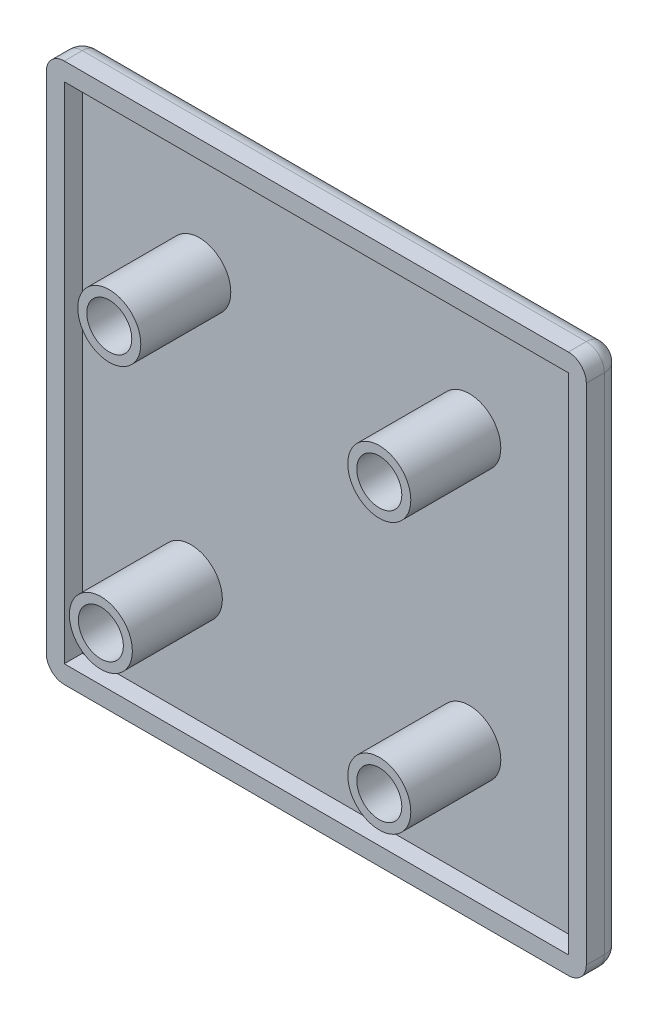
ISO-10303-21;
HEADER;
FILE_DESCRIPTION(('STEP AP214'),'2;1');
FILE_NAME('part.step','',(''),(''),'','','');
FILE_SCHEMA(('AUTOMOTIVE_DESIGN { 1 0 10303 214 1 1 1 1 }'));
ENDSEC;
DATA;
#1=APPLICATION_CONTEXT('core data for automotive mechanical design processes');
#2=APPLICATION_PROTOCOL_DEFINITION('international standard','automotive_design',2000,#1);
#3=PRODUCT_CONTEXT('',#1,'mechanical');
#4=PRODUCT('Part','Part','',(#3));
#5=PRODUCT_RELATED_PRODUCT_CATEGORY('part','',(#4));
#6=PRODUCT_DEFINITION_FORMATION('','',#4);
#7=PRODUCT_DEFINITION_CONTEXT('part definition',#1,'design');
#8=PRODUCT_DEFINITION('design','',#6,#7);
#9=PRODUCT_DEFINITION_SHAPE('','',#8);
#10=(LENGTH_UNIT() NAMED_UNIT(*) SI_UNIT(.MILLI.,.METRE.));
#11=(NAMED_UNIT(*) PLANE_ANGLE_UNIT() SI_UNIT($,.RADIAN.));
#12=(NAMED_UNIT(*) SI_UNIT($,.STERADIAN.) SOLID_ANGLE_UNIT());
#13=UNCERTAINTY_MEASURE_WITH_UNIT(LENGTH_MEASURE(1.E-05),#10,'distance_accuracy_value','');
#14=(GEOMETRIC_REPRESENTATION_CONTEXT(3) GLOBAL_UNCERTAINTY_ASSIGNED_CONTEXT((#13)) GLOBAL_UNIT_ASSIGNED_CONTEXT((#10,
#11,#12)) REPRESENTATION_CONTEXT('',''));
#15=CARTESIAN_POINT('',(0.,0.,0.));
#16=DIRECTION('',(0.,0.,1.));
#17=DIRECTION('',(1.,0.,0.));
#18=AXIS2_PLACEMENT_3D('',#15,#16,#17);
#19=CARTESIAN_POINT('',(0.,0.,0.));
#20=DIRECTION('',(0.,0.,1.));
#21=DIRECTION('',(1.,0.,0.));
#22=AXIS2_PLACEMENT_3D('',#19,#20,#21);
#23=PLANE('',#22);
#24=DIRECTION('',(0.,-1.,0.));
#25=VECTOR('',#24,1.);
#26=CARTESIAN_POINT('',(-28.,30.,0.));
#27=LINE('',#26,#25);
#28=CARTESIAN_POINT('',(-28.,28.,0.));
#29=VERTEX_POINT('',#28);
#30=CARTESIAN_POINT('',(-28.,-28.,0.));
#31=VERTEX_POINT('',#30);
#32=EDGE_CURVE('E140',#29,#31,#27,.T.);
#33=ORIENTED_EDGE('',*,*,#32,.T.);
#34=DIRECTION('',(1.,0.,0.));
#35=VECTOR('',#34,1.);
#36=CARTESIAN_POINT('',(-30.,-28.,0.));
#37=LINE('',#36,#35);
#38=CARTESIAN_POINT('',(28.,-28.,0.));
#39=VERTEX_POINT('',#38);
#40=EDGE_CURVE('E133',#31,#39,#37,.T.);
#41=ORIENTED_EDGE('',*,*,#40,.T.);
#42=DIRECTION('',(0.,1.,0.));
#43=VECTOR('',#42,1.);
#44=CARTESIAN_POINT('',(28.,30.,0.));
#45=LINE('',#44,#43);
#46=CARTESIAN_POINT('',(28.,28.,0.));
#47=VERTEX_POINT('',#46);
#48=EDGE_CURVE('E137',#39,#47,#45,.T.);
#49=ORIENTED_EDGE('',*,*,#48,.T.);
#50=DIRECTION('',(-1.,0.,0.));
#51=VECTOR('',#50,1.);
#52=CARTESIAN_POINT('',(-30.,28.,0.));
#53=LINE('',#52,#51);
#54=EDGE_CURVE('E158',#47,#29,#53,.T.);
#55=ORIENTED_EDGE('',*,*,#54,.T.);
#56=EDGE_LOOP('',(#33,#41,#49,#55));
#57=FACE_BOUND('',#56,.T.);
#58=CARTESIAN_POINT('',(-15.,15.,0.));
#59=DIRECTION('',(0.,0.,1.));
#60=DIRECTION('',(1.,0.,0.));
#61=AXIS2_PLACEMENT_3D('',#58,#59,#60);
#62=CIRCLE('',#61,3.5);
#63=CARTESIAN_POINT('',(-11.5,15.,0.));
#64=VERTEX_POINT('',#63);
#65=EDGE_CURVE('E353',#64,#64,#62,.T.);
#66=ORIENTED_EDGE('',*,*,#65,.F.);
#67=EDGE_LOOP('',(#66));
#68=FACE_BOUND('',#67,.T.);
#69=CARTESIAN_POINT('',(15.,15.,0.));
#70=DIRECTION('',(0.,0.,1.));
#71=DIRECTION('',(1.,0.,0.));
#72=AXIS2_PLACEMENT_3D('',#69,#70,#71);
#73=CIRCLE('',#72,3.5);
#74=CARTESIAN_POINT('',(18.5,15.,0.));
#75=VERTEX_POINT('',#74);
#76=EDGE_CURVE('E361',#75,#75,#73,.T.);
#77=ORIENTED_EDGE('',*,*,#76,.F.);
#78=EDGE_LOOP('',(#77));
#79=FACE_BOUND('',#78,.T.);
#80=CARTESIAN_POINT('',(15.,-15.,0.));
#81=DIRECTION('',(0.,0.,1.));
#82=DIRECTION('',(1.,0.,0.));
#83=AXIS2_PLACEMENT_3D('',#80,#81,#82);
#84=CIRCLE('',#83,3.5);
#85=CARTESIAN_POINT('',(18.5,-15.,0.));
#86=VERTEX_POINT('',#85);
#87=EDGE_CURVE('E370',#86,#86,#84,.T.);
#88=ORIENTED_EDGE('',*,*,#87,.F.);
#89=EDGE_LOOP('',(#88));
#90=FACE_BOUND('',#89,.T.);
#91=CARTESIAN_POINT('',(-15.9380449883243,-15.,0.));
#92=DIRECTION('',(0.,0.,1.));
#93=DIRECTION('',(1.,0.,0.));
#94=AXIS2_PLACEMENT_3D('',#91,#92,#93);
#95=CIRCLE('',#94,3.5);
#96=CARTESIAN_POINT('',(-12.4380449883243,-15.,0.));
#97=VERTEX_POINT('',#96);
#98=EDGE_CURVE('E379',#97,#97,#95,.T.);
#99=ORIENTED_EDGE('',*,*,#98,.F.);
#100=EDGE_LOOP('',(#99));
#101=FACE_BOUND('',#100,.T.);
#102=ADVANCED_FACE('F33',(#57,#68,#79,#90,#101),#23,.T.);
#103=CARTESIAN_POINT('',(-30.,30.,2.));
#104=DIRECTION('',(1.,0.,0.));
#105=DIRECTION('',(0.,1.,0.));
#106=AXIS2_PLACEMENT_3D('',#103,#104,#105);
#107=PLANE('',#106);
#108=DIRECTION('',(0.,-1.,0.));
#109=VECTOR('',#108,1.);
#110=CARTESIAN_POINT('',(-30.,30.,2.));
#111=LINE('',#110,#109);
#112=CARTESIAN_POINT('',(-30.,28.,2.));
#113=VERTEX_POINT('',#112);
#114=CARTESIAN_POINT('',(-30.,-28.,2.));
#115=VERTEX_POINT('',#114);
#116=EDGE_CURVE('E171',#113,#115,#111,.T.);
#117=ORIENTED_EDGE('',*,*,#116,.F.);
#118=DIRECTION('',(0.,0.,-1.));
#119=VECTOR('',#118,1.);
#120=CARTESIAN_POINT('',(-30.,28.,2.));
#121=LINE('',#120,#119);
#122=CARTESIAN_POINT('',(-30.,28.,0.));
#123=VERTEX_POINT('',#122);
#124=EDGE_CURVE('E187',#113,#123,#121,.T.);
#125=ORIENTED_EDGE('',*,*,#124,.T.);
#126=DIRECTION('',(0.,-1.,0.));
#127=VECTOR('',#126,1.);
#128=CARTESIAN_POINT('',(-30.,30.,0.));
#129=LINE('',#128,#127);
#130=CARTESIAN_POINT('',(-30.,-28.,0.));
#131=VERTEX_POINT('',#130);
#132=EDGE_CURVE('E183',#123,#131,#129,.T.);
#133=ORIENTED_EDGE('',*,*,#132,.T.);
#134=DIRECTION('',(0.,0.,-1.));
#135=VECTOR('',#134,1.);
#136=CARTESIAN_POINT('',(-30.,-28.,2.));
#137=LINE('',#136,#135);
#138=EDGE_CURVE('E185',#131,#115,#137,.F.);
#139=ORIENTED_EDGE('',*,*,#138,.T.);
#140=EDGE_LOOP('',(#117,#125,#133,#139));
#141=FACE_BOUND('',#140,.T.);
#142=ADVANCED_FACE('F293',(#141),#107,.F.);
#143=CARTESIAN_POINT('',(-30.,-30.,2.));
#144=DIRECTION('',(0.,1.,0.));
#145=DIRECTION('',(0.,0.,1.));
#146=AXIS2_PLACEMENT_3D('',#143,#144,#145);
#147=PLANE('',#146);
#148=DIRECTION('',(1.,0.,0.));
#149=VECTOR('',#148,1.);
#150=CARTESIAN_POINT('',(-30.,-30.,0.));
#151=LINE('',#150,#149);
#152=CARTESIAN_POINT('',(-28.,-30.,0.));
#153=VERTEX_POINT('',#152);
#154=CARTESIAN_POINT('',(28.,-30.,0.));
#155=VERTEX_POINT('',#154);
#156=EDGE_CURVE('E210',#153,#155,#151,.T.);
#157=ORIENTED_EDGE('',*,*,#156,.T.);
#158=DIRECTION('',(0.,0.,-1.));
#159=VECTOR('',#158,1.);
#160=CARTESIAN_POINT('',(28.,-30.,2.));
#161=LINE('',#160,#159);
#162=CARTESIAN_POINT('',(28.,-30.,2.));
#163=VERTEX_POINT('',#162);
#164=EDGE_CURVE('E214',#155,#163,#161,.F.);
#165=ORIENTED_EDGE('',*,*,#164,.T.);
#166=DIRECTION('',(1.,0.,0.));
#167=VECTOR('',#166,1.);
#168=CARTESIAN_POINT('',(-30.,-30.,2.));
#169=LINE('',#168,#167);
#170=CARTESIAN_POINT('',(-28.,-30.,2.));
#171=VERTEX_POINT('',#170);
#172=EDGE_CURVE('E174',#171,#163,#169,.T.);
#173=ORIENTED_EDGE('',*,*,#172,.F.);
#174=DIRECTION('',(0.,0.,-1.));
#175=VECTOR('',#174,1.);
#176=CARTESIAN_POINT('',(-28.,-30.,2.));
#177=LINE('',#176,#175);
#178=EDGE_CURVE('E212',#171,#153,#177,.T.);
#179=ORIENTED_EDGE('',*,*,#178,.T.);
#180=EDGE_LOOP('',(#157,#165,#173,#179));
#181=FACE_BOUND('',#180,.T.);
#182=ADVANCED_FACE('F297',(#181),#147,.F.);
#183=CARTESIAN_POINT('',(30.,30.,2.));
#184=DIRECTION('',(-1.,0.,0.));
#185=DIRECTION('',(0.,0.,1.));
#186=AXIS2_PLACEMENT_3D('',#183,#184,#185);
#187=PLANE('',#186);
#188=DIRECTION('',(0.,1.,0.));
#189=VECTOR('',#188,1.);
#190=CARTESIAN_POINT('',(30.,30.,2.));
#191=LINE('',#190,#189);
#192=CARTESIAN_POINT('',(30.,-28.,2.));
#193=VERTEX_POINT('',#192);
#194=CARTESIAN_POINT('',(30.,28.,2.));
#195=VERTEX_POINT('',#194);
#196=EDGE_CURVE('E177',#193,#195,#191,.T.);
#197=ORIENTED_EDGE('',*,*,#196,.F.);
#198=DIRECTION('',(0.,0.,-1.));
#199=VECTOR('',#198,1.);
#200=CARTESIAN_POINT('',(30.,-28.,2.));
#201=LINE('',#200,#199);
#202=CARTESIAN_POINT('',(30.,-28.,0.));
#203=VERTEX_POINT('',#202);
#204=EDGE_CURVE('E208',#193,#203,#201,.T.);
#205=ORIENTED_EDGE('',*,*,#204,.T.);
#206=DIRECTION('',(0.,1.,0.));
#207=VECTOR('',#206,1.);
#208=CARTESIAN_POINT('',(30.,30.,0.));
#209=LINE('',#208,#207);
#210=CARTESIAN_POINT('',(30.,28.,0.));
#211=VERTEX_POINT('',#210);
#212=EDGE_CURVE('E206',#203,#211,#209,.T.);
#213=ORIENTED_EDGE('',*,*,#212,.T.);
#214=DIRECTION('',(0.,0.,-1.));
#215=VECTOR('',#214,1.);
#216=CARTESIAN_POINT('',(30.,28.,2.));
#217=LINE('',#216,#215);
#218=EDGE_CURVE('E204',#211,#195,#217,.F.);
#219=ORIENTED_EDGE('',*,*,#218,.T.);
#220=EDGE_LOOP('',(#197,#205,#213,#219));
#221=FACE_BOUND('',#220,.T.);
#222=ADVANCED_FACE('F599',(#221),#187,.F.);
#223=CARTESIAN_POINT('',(-30.,30.,2.));
#224=DIRECTION('',(0.,-1.,0.));
#225=DIRECTION('',(1.,0.,0.));
#226=AXIS2_PLACEMENT_3D('',#223,#224,#225);
#227=PLANE('',#226);
#228=DIRECTION('',(-1.,0.,0.));
#229=VECTOR('',#228,1.);
#230=CARTESIAN_POINT('',(-30.,30.,0.));
#231=LINE('',#230,#229);
#232=CARTESIAN_POINT('',(28.,30.,0.));
#233=VERTEX_POINT('',#232);
#234=CARTESIAN_POINT('',(-28.,30.,0.));
#235=VERTEX_POINT('',#234);
#236=EDGE_CURVE('E192',#233,#235,#231,.T.);
#237=ORIENTED_EDGE('',*,*,#236,.T.);
#238=DIRECTION('',(0.,0.,-1.));
#239=VECTOR('',#238,1.);
#240=CARTESIAN_POINT('',(-28.,30.,2.));
#241=LINE('',#240,#239);
#242=CARTESIAN_POINT('',(-28.,30.,2.));
#243=VERTEX_POINT('',#242);
#244=EDGE_CURVE('E194',#235,#243,#241,.F.);
#245=ORIENTED_EDGE('',*,*,#244,.T.);
#246=DIRECTION('',(-1.,0.,0.));
#247=VECTOR('',#246,1.);
#248=CARTESIAN_POINT('',(-30.,30.,2.));
#249=LINE('',#248,#247);
#250=CARTESIAN_POINT('',(28.,30.,2.));
#251=VERTEX_POINT('',#250);
#252=EDGE_CURVE('E180',#251,#243,#249,.T.);
#253=ORIENTED_EDGE('',*,*,#252,.F.);
#254=DIRECTION('',(0.,0.,-1.));
#255=VECTOR('',#254,1.);
#256=CARTESIAN_POINT('',(28.,30.,2.));
#257=LINE('',#256,#255);
#258=EDGE_CURVE('E190',#251,#233,#257,.T.);
#259=ORIENTED_EDGE('',*,*,#258,.T.);
#260=EDGE_LOOP('',(#237,#245,#253,#259));
#261=FACE_BOUND('',#260,.T.);
#262=ADVANCED_FACE('F590',(#261),#227,.F.);
#263=CARTESIAN_POINT('',(0.,0.,2.));
#264=DIRECTION('',(0.,0.,1.));
#265=DIRECTION('',(1.,0.,0.));
#266=AXIS2_PLACEMENT_3D('',#263,#264,#265);
#267=PLANE('',#266);
#268=DIRECTION('',(0.,-1.,0.));
#269=VECTOR('',#268,1.);
#270=CARTESIAN_POINT('',(-28.,30.,2.));
#271=LINE('',#270,#269);
#272=CARTESIAN_POINT('',(-28.,28.,2.));
#273=VERTEX_POINT('',#272);
#274=CARTESIAN_POINT('',(-28.,-28.,2.));
#275=VERTEX_POINT('',#274);
#276=EDGE_CURVE('E160',#273,#275,#271,.T.);
#277=ORIENTED_EDGE('',*,*,#276,.F.);
#278=DIRECTION('',(-1.,0.,0.));
#279=VECTOR('',#278,1.);
#280=CARTESIAN_POINT('',(-30.,28.,2.));
#281=LINE('',#280,#279);
#282=CARTESIAN_POINT('',(28.,28.,2.));
#283=VERTEX_POINT('',#282);
#284=EDGE_CURVE('E169',#283,#273,#281,.T.);
#285=ORIENTED_EDGE('',*,*,#284,.F.);
#286=DIRECTION('',(0.,1.,0.));
#287=VECTOR('',#286,1.);
#288=CARTESIAN_POINT('',(28.,30.,2.));
#289=LINE('',#288,#287);
#290=CARTESIAN_POINT('',(28.,-28.,2.));
#291=VERTEX_POINT('',#290);
#292=EDGE_CURVE('E167',#291,#283,#289,.T.);
#293=ORIENTED_EDGE('',*,*,#292,.F.);
#294=DIRECTION('',(1.,0.,0.));
#295=VECTOR('',#294,1.);
#296=CARTESIAN_POINT('',(-30.,-28.,2.));
#297=LINE('',#296,#295);
#298=EDGE_CURVE('E149',#275,#291,#297,.T.);
#299=ORIENTED_EDGE('',*,*,#298,.F.);
#300=EDGE_LOOP('',(#277,#285,#293,#299));
#301=FACE_BOUND('',#300,.T.);
#302=ORIENTED_EDGE('',*,*,#252,.T.);
#303=CARTESIAN_POINT('',(-28.,28.,2.));
#304=DIRECTION('',(0.,0.,1.));
#305=DIRECTION('',(1.,0.,0.));
#306=AXIS2_PLACEMENT_3D('',#303,#304,#305);
#307=CIRCLE('',#306,2.);
#308=EDGE_CURVE('E202',#243,#113,#307,.T.);
#309=ORIENTED_EDGE('',*,*,#308,.T.);
#310=ORIENTED_EDGE('',*,*,#116,.T.);
#311=CARTESIAN_POINT('',(-28.,-28.,2.));
#312=DIRECTION('',(0.,0.,1.));
#313=DIRECTION('',(1.,0.,0.));
#314=AXIS2_PLACEMENT_3D('',#311,#312,#313);
#315=CIRCLE('',#314,2.);
#316=EDGE_CURVE('E198',#115,#171,#315,.T.);
#317=ORIENTED_EDGE('',*,*,#316,.T.);
#318=ORIENTED_EDGE('',*,*,#172,.T.);
#319=CARTESIAN_POINT('',(28.,-28.,2.));
#320=DIRECTION('',(0.,0.,1.));
#321=DIRECTION('',(1.,0.,0.));
#322=AXIS2_PLACEMENT_3D('',#319,#320,#321);
#323=CIRCLE('',#322,2.);
#324=EDGE_CURVE('E200',#163,#193,#323,.T.);
#325=ORIENTED_EDGE('',*,*,#324,.T.);
#326=ORIENTED_EDGE('',*,*,#196,.T.);
#327=CARTESIAN_POINT('',(28.,28.,2.));
#328=DIRECTION('',(0.,0.,1.));
#329=DIRECTION('',(1.,0.,0.));
#330=AXIS2_PLACEMENT_3D('',#327,#328,#329);
#331=CIRCLE('',#330,2.);
#332=EDGE_CURVE('E196',#195,#251,#331,.T.);
#333=ORIENTED_EDGE('',*,*,#332,.T.);
#334=EDGE_LOOP('',(#302,#309,#310,#317,#318,#325,#326,#333));
#335=FACE_BOUND('',#334,.T.);
#336=ADVANCED_FACE('F580',(#301,#335),#267,.T.);
#337=CARTESIAN_POINT('',(0.,0.,-2.));
#338=DIRECTION('',(0.,0.,1.));
#339=DIRECTION('',(1.,0.,0.));
#340=AXIS2_PLACEMENT_3D('',#337,#338,#339);
#341=PLANE('',#340);
#342=DIRECTION('',(1.,0.,0.));
#343=VECTOR('',#342,1.);
#344=CARTESIAN_POINT('',(0.,-28.,-2.));
#345=LINE('',#344,#343);
#346=CARTESIAN_POINT('',(28.,-28.,-2.));
#347=VERTEX_POINT('',#346);
#348=CARTESIAN_POINT('',(-28.,-28.,-2.));
#349=VERTEX_POINT('',#348);
#350=EDGE_CURVE('E48',#347,#349,#345,.F.);
#351=ORIENTED_EDGE('',*,*,#350,.T.);
#352=DIRECTION('',(0.,-1.,0.));
#353=VECTOR('',#352,1.);
#354=CARTESIAN_POINT('',(-28.,0.,-2.));
#355=LINE('',#354,#353);
#356=CARTESIAN_POINT('',(-28.,28.,-2.));
#357=VERTEX_POINT('',#356);
#358=EDGE_CURVE('E220',#349,#357,#355,.F.);
#359=ORIENTED_EDGE('',*,*,#358,.T.);
#360=DIRECTION('',(-1.,0.,0.));
#361=VECTOR('',#360,1.);
#362=CARTESIAN_POINT('',(0.,28.,-2.));
#363=LINE('',#362,#361);
#364=CARTESIAN_POINT('',(28.,28.,-2.));
#365=VERTEX_POINT('',#364);
#366=EDGE_CURVE('E216',#357,#365,#363,.F.);
#367=ORIENTED_EDGE('',*,*,#366,.T.);
#368=DIRECTION('',(0.,1.,0.));
#369=VECTOR('',#368,1.);
#370=CARTESIAN_POINT('',(28.,0.,-2.));
#371=LINE('',#370,#369);
#372=EDGE_CURVE('E53',#365,#347,#371,.F.);
#373=ORIENTED_EDGE('',*,*,#372,.T.);
#374=EDGE_LOOP('',(#351,#359,#367,#373));
#375=FACE_BOUND('',#374,.T.);
#376=ADVANCED_FACE('F332',(#375),#341,.F.);
#377=CARTESIAN_POINT('',(-28.,30.,2.));
#378=DIRECTION('',(1.,0.,0.));
#379=DIRECTION('',(0.,1.,0.));
#380=AXIS2_PLACEMENT_3D('',#377,#378,#379);
#381=PLANE('',#380);
#382=ORIENTED_EDGE('',*,*,#32,.F.);
#383=DIRECTION('',(0.,0.,-1.));
#384=VECTOR('',#383,1.);
#385=CARTESIAN_POINT('',(-28.,28.,2.));
#386=LINE('',#385,#384);
#387=EDGE_CURVE('E163',#273,#29,#386,.T.);
#388=ORIENTED_EDGE('',*,*,#387,.F.);
#389=ORIENTED_EDGE('',*,*,#276,.T.);
#390=DIRECTION('',(0.,0.,-1.));
#391=VECTOR('',#390,1.);
#392=CARTESIAN_POINT('',(-28.,-28.,2.));
#393=LINE('',#392,#391);
#394=EDGE_CURVE('E153',#275,#31,#393,.T.);
#395=ORIENTED_EDGE('',*,*,#394,.T.);
#396=EDGE_LOOP('',(#382,#388,#389,#395));
#397=FACE_BOUND('',#396,.T.);
#398=ADVANCED_FACE('F329',(#397),#381,.T.);
#399=CARTESIAN_POINT('',(-30.,-28.,2.));
#400=DIRECTION('',(0.,1.,0.));
#401=DIRECTION('',(0.,0.,1.));
#402=AXIS2_PLACEMENT_3D('',#399,#400,#401);
#403=PLANE('',#402);
#404=ORIENTED_EDGE('',*,*,#40,.F.);
#405=ORIENTED_EDGE('',*,*,#394,.F.);
#406=ORIENTED_EDGE('',*,*,#298,.T.);
#407=DIRECTION('',(0.,0.,-1.));
#408=VECTOR('',#407,1.);
#409=CARTESIAN_POINT('',(28.,-28.,2.));
#410=LINE('',#409,#408);
#411=EDGE_CURVE('E146',#291,#39,#410,.T.);
#412=ORIENTED_EDGE('',*,*,#411,.T.);
#413=EDGE_LOOP('',(#404,#405,#406,#412));
#414=FACE_BOUND('',#413,.T.);
#415=ADVANCED_FACE('F147',(#414),#403,.T.);
#416=CARTESIAN_POINT('',(28.,30.,2.));
#417=DIRECTION('',(-1.,0.,0.));
#418=DIRECTION('',(0.,0.,1.));
#419=AXIS2_PLACEMENT_3D('',#416,#417,#418);
#420=PLANE('',#419);
#421=ORIENTED_EDGE('',*,*,#48,.F.);
#422=ORIENTED_EDGE('',*,*,#411,.F.);
#423=ORIENTED_EDGE('',*,*,#292,.T.);
#424=DIRECTION('',(0.,0.,-1.));
#425=VECTOR('',#424,1.);
#426=CARTESIAN_POINT('',(28.,28.,2.));
#427=LINE('',#426,#425);
#428=EDGE_CURVE('E154',#283,#47,#427,.T.);
#429=ORIENTED_EDGE('',*,*,#428,.T.);
#430=EDGE_LOOP('',(#421,#422,#423,#429));
#431=FACE_BOUND('',#430,.T.);
#432=ADVANCED_FACE('F156',(#431),#420,.T.);
#433=CARTESIAN_POINT('',(-30.,28.,2.));
#434=DIRECTION('',(0.,-1.,0.));
#435=DIRECTION('',(1.,0.,0.));
#436=AXIS2_PLACEMENT_3D('',#433,#434,#435);
#437=PLANE('',#436);
#438=ORIENTED_EDGE('',*,*,#54,.F.);
#439=ORIENTED_EDGE('',*,*,#428,.F.);
#440=ORIENTED_EDGE('',*,*,#284,.T.);
#441=ORIENTED_EDGE('',*,*,#387,.T.);
#442=EDGE_LOOP('',(#438,#439,#440,#441));
#443=FACE_BOUND('',#442,.T.);
#444=ADVANCED_FACE('F337',(#443),#437,.T.);
#445=CARTESIAN_POINT('',(28.,-28.,2.));
#446=DIRECTION('',(0.,0.,-1.));
#447=DIRECTION('',(-1.,0.,0.));
#448=AXIS2_PLACEMENT_3D('',#445,#446,#447);
#449=CYLINDRICAL_SURFACE('',#448,2.);
#450=CARTESIAN_POINT('',(28.,-28.,0.));
#451=DIRECTION('',(0.,0.,-1.));
#452=DIRECTION('',(-1.,0.,0.));
#453=AXIS2_PLACEMENT_3D('',#450,#451,#452);
#454=CIRCLE('',#453,2.);
#455=EDGE_CURVE('E254',#203,#155,#454,.T.);
#456=ORIENTED_EDGE('',*,*,#455,.F.);
#457=ORIENTED_EDGE('',*,*,#204,.F.);
#458=ORIENTED_EDGE('',*,*,#324,.F.);
#459=ORIENTED_EDGE('',*,*,#164,.F.);
#460=EDGE_LOOP('',(#456,#457,#458,#459));
#461=FACE_BOUND('',#460,.T.);
#462=ADVANCED_FACE('F35',(#461),#449,.T.);
#463=CARTESIAN_POINT('',(28.,-28.,0.));
#464=DIRECTION('',(0.,0.,1.));
#465=DIRECTION('',(1.,0.,0.));
#466=AXIS2_PLACEMENT_3D('',#463,#464,#465);
#467=SPHERICAL_SURFACE('',#466,2.);
#468=CARTESIAN_POINT('',(28.,-28.,0.));
#469=DIRECTION('',(0.,-1.,0.));
#470=DIRECTION('',(1.,0.,0.));
#471=AXIS2_PLACEMENT_3D('',#468,#469,#470);
#472=CIRCLE('',#471,2.);
#473=EDGE_CURVE('E249',#203,#347,#472,.F.);
#474=ORIENTED_EDGE('',*,*,#473,.F.);
#475=ORIENTED_EDGE('',*,*,#455,.T.);
#476=CARTESIAN_POINT('',(28.,-28.,0.));
#477=DIRECTION('',(1.,0.,0.));
#478=DIRECTION('',(0.,0.,-1.));
#479=AXIS2_PLACEMENT_3D('',#476,#477,#478);
#480=CIRCLE('',#479,2.);
#481=EDGE_CURVE('E251',#347,#155,#480,.F.);
#482=ORIENTED_EDGE('',*,*,#481,.F.);
#483=EDGE_LOOP('',(#474,#475,#482));
#484=FACE_BOUND('',#483,.T.);
#485=ADVANCED_FACE('F343',(#484),#467,.T.);
#486=CARTESIAN_POINT('',(-28.,-28.,2.));
#487=DIRECTION('',(0.,0.,-1.));
#488=DIRECTION('',(-1.,0.,0.));
#489=AXIS2_PLACEMENT_3D('',#486,#487,#488);
#490=CYLINDRICAL_SURFACE('',#489,2.);
#491=ORIENTED_EDGE('',*,*,#316,.F.);
#492=ORIENTED_EDGE('',*,*,#138,.F.);
#493=CARTESIAN_POINT('',(-28.,-28.,0.));
#494=DIRECTION('',(0.,0.,-1.));
#495=DIRECTION('',(-1.,0.,0.));
#496=AXIS2_PLACEMENT_3D('',#493,#494,#495);
#497=CIRCLE('',#496,2.);
#498=EDGE_CURVE('E246',#153,#131,#497,.T.);
#499=ORIENTED_EDGE('',*,*,#498,.F.);
#500=ORIENTED_EDGE('',*,*,#178,.F.);
#501=EDGE_LOOP('',(#491,#492,#499,#500));
#502=FACE_BOUND('',#501,.T.);
#503=ADVANCED_FACE('F548',(#502),#490,.T.);
#504=CARTESIAN_POINT('',(-30.,-28.,0.));
#505=DIRECTION('',(1.,0.,0.));
#506=DIRECTION('',(0.,0.,-1.));
#507=AXIS2_PLACEMENT_3D('',#504,#505,#506);
#508=CYLINDRICAL_SURFACE('',#507,2.);
#509=ORIENTED_EDGE('',*,*,#481,.T.);
#510=ORIENTED_EDGE('',*,*,#156,.F.);
#511=CARTESIAN_POINT('',(-28.,-28.,0.));
#512=DIRECTION('',(-1.,0.,0.));
#513=DIRECTION('',(0.,0.,1.));
#514=AXIS2_PLACEMENT_3D('',#511,#512,#513);
#515=CIRCLE('',#514,2.);
#516=EDGE_CURVE('E243',#349,#153,#515,.T.);
#517=ORIENTED_EDGE('',*,*,#516,.F.);
#518=ORIENTED_EDGE('',*,*,#350,.F.);
#519=EDGE_LOOP('',(#509,#510,#517,#518));
#520=FACE_BOUND('',#519,.T.);
#521=ADVANCED_FACE('F538',(#520),#508,.T.);
#522=CARTESIAN_POINT('',(28.,30.,0.));
#523=DIRECTION('',(0.,1.,0.));
#524=DIRECTION('',(0.,0.,1.));
#525=AXIS2_PLACEMENT_3D('',#522,#523,#524);
#526=CYLINDRICAL_SURFACE('',#525,2.);
#527=ORIENTED_EDGE('',*,*,#473,.T.);
#528=ORIENTED_EDGE('',*,*,#372,.F.);
#529=CARTESIAN_POINT('',(28.,28.,0.));
#530=DIRECTION('',(0.,1.,0.));
#531=DIRECTION('',(0.,0.,1.));
#532=AXIS2_PLACEMENT_3D('',#529,#530,#531);
#533=CIRCLE('',#532,2.);
#534=EDGE_CURVE('E240',#211,#365,#533,.T.);
#535=ORIENTED_EDGE('',*,*,#534,.F.);
#536=ORIENTED_EDGE('',*,*,#212,.F.);
#537=EDGE_LOOP('',(#527,#528,#535,#536));
#538=FACE_BOUND('',#537,.T.);
#539=ADVANCED_FACE('F528',(#538),#526,.T.);
#540=CARTESIAN_POINT('',(28.,28.,2.));
#541=DIRECTION('',(0.,0.,-1.));
#542=DIRECTION('',(-1.,0.,0.));
#543=AXIS2_PLACEMENT_3D('',#540,#541,#542);
#544=CYLINDRICAL_SURFACE('',#543,2.);
#545=ORIENTED_EDGE('',*,*,#332,.F.);
#546=ORIENTED_EDGE('',*,*,#218,.F.);
#547=CARTESIAN_POINT('',(28.,28.,0.));
#548=DIRECTION('',(0.,0.,-1.));
#549=DIRECTION('',(-1.,0.,0.));
#550=AXIS2_PLACEMENT_3D('',#547,#548,#549);
#551=CIRCLE('',#550,2.);
#552=EDGE_CURVE('E237',#233,#211,#551,.T.);
#553=ORIENTED_EDGE('',*,*,#552,.F.);
#554=ORIENTED_EDGE('',*,*,#258,.F.);
#555=EDGE_LOOP('',(#545,#546,#553,#554));
#556=FACE_BOUND('',#555,.T.);
#557=ADVANCED_FACE('F518',(#556),#544,.T.);
#558=CARTESIAN_POINT('',(-28.,-28.,0.));
#559=DIRECTION('',(0.,0.,1.));
#560=DIRECTION('',(1.,0.,0.));
#561=AXIS2_PLACEMENT_3D('',#558,#559,#560);
#562=SPHERICAL_SURFACE('',#561,2.);
#563=ORIENTED_EDGE('',*,*,#516,.T.);
#564=ORIENTED_EDGE('',*,*,#498,.T.);
#565=CARTESIAN_POINT('',(-28.,-28.,0.));
#566=DIRECTION('',(0.,-1.,0.));
#567=DIRECTION('',(0.,0.,-1.));
#568=AXIS2_PLACEMENT_3D('',#565,#566,#567);
#569=CIRCLE('',#568,2.);
#570=EDGE_CURVE('E234',#349,#131,#569,.F.);
#571=ORIENTED_EDGE('',*,*,#570,.F.);
#572=EDGE_LOOP('',(#563,#564,#571));
#573=FACE_BOUND('',#572,.T.);
#574=ADVANCED_FACE('F508',(#573),#562,.T.);
#575=CARTESIAN_POINT('',(28.,28.,0.));
#576=DIRECTION('',(0.,0.,1.));
#577=DIRECTION('',(1.,0.,0.));
#578=AXIS2_PLACEMENT_3D('',#575,#576,#577);
#579=SPHERICAL_SURFACE('',#578,2.);
#580=ORIENTED_EDGE('',*,*,#552,.T.);
#581=ORIENTED_EDGE('',*,*,#534,.T.);
#582=CARTESIAN_POINT('',(28.,28.,0.));
#583=DIRECTION('',(1.,0.,0.));
#584=DIRECTION('',(0.,1.,0.));
#585=AXIS2_PLACEMENT_3D('',#582,#583,#584);
#586=CIRCLE('',#585,2.);
#587=EDGE_CURVE('E231',#233,#365,#586,.F.);
#588=ORIENTED_EDGE('',*,*,#587,.F.);
#589=EDGE_LOOP('',(#580,#581,#588));
#590=FACE_BOUND('',#589,.T.);
#591=ADVANCED_FACE('F498',(#590),#579,.T.);
#592=CARTESIAN_POINT('',(-28.,30.,0.));
#593=DIRECTION('',(0.,-1.,0.));
#594=DIRECTION('',(1.,0.,0.));
#595=AXIS2_PLACEMENT_3D('',#592,#593,#594);
#596=CYLINDRICAL_SURFACE('',#595,2.);
#597=ORIENTED_EDGE('',*,*,#570,.T.);
#598=ORIENTED_EDGE('',*,*,#132,.F.);
#599=CARTESIAN_POINT('',(-28.,28.,0.));
#600=DIRECTION('',(0.,1.,0.));
#601=DIRECTION('',(0.,0.,1.));
#602=AXIS2_PLACEMENT_3D('',#599,#600,#601);
#603=CIRCLE('',#602,2.);
#604=EDGE_CURVE('E228',#357,#123,#603,.T.);
#605=ORIENTED_EDGE('',*,*,#604,.F.);
#606=ORIENTED_EDGE('',*,*,#358,.F.);
#607=EDGE_LOOP('',(#597,#598,#605,#606));
#608=FACE_BOUND('',#607,.T.);
#609=ADVANCED_FACE('F488',(#608),#596,.T.);
#610=CARTESIAN_POINT('',(-30.,28.,0.));
#611=DIRECTION('',(-1.,0.,0.));
#612=DIRECTION('',(0.,-1.,0.));
#613=AXIS2_PLACEMENT_3D('',#610,#611,#612);
#614=CYLINDRICAL_SURFACE('',#613,2.);
#615=ORIENTED_EDGE('',*,*,#587,.T.);
#616=ORIENTED_EDGE('',*,*,#366,.F.);
#617=CARTESIAN_POINT('',(-28.,28.,0.));
#618=DIRECTION('',(-1.,0.,0.));
#619=DIRECTION('',(0.,0.,1.));
#620=AXIS2_PLACEMENT_3D('',#617,#618,#619);
#621=CIRCLE('',#620,2.);
#622=EDGE_CURVE('E225',#235,#357,#621,.T.);
#623=ORIENTED_EDGE('',*,*,#622,.F.);
#624=ORIENTED_EDGE('',*,*,#236,.F.);
#625=EDGE_LOOP('',(#615,#616,#623,#624));
#626=FACE_BOUND('',#625,.T.);
#627=ADVANCED_FACE('F478',(#626),#614,.T.);
#628=CARTESIAN_POINT('',(-28.,28.,0.));
#629=DIRECTION('',(0.,0.,1.));
#630=DIRECTION('',(1.,0.,0.));
#631=AXIS2_PLACEMENT_3D('',#628,#629,#630);
#632=SPHERICAL_SURFACE('',#631,2.);
#633=ORIENTED_EDGE('',*,*,#622,.T.);
#634=ORIENTED_EDGE('',*,*,#604,.T.);
#635=CARTESIAN_POINT('',(-28.,28.,0.));
#636=DIRECTION('',(0.,0.,-1.));
#637=DIRECTION('',(-1.,0.,0.));
#638=AXIS2_PLACEMENT_3D('',#635,#636,#637);
#639=CIRCLE('',#638,2.);
#640=EDGE_CURVE('E223',#235,#123,#639,.F.);
#641=ORIENTED_EDGE('',*,*,#640,.F.);
#642=EDGE_LOOP('',(#633,#634,#641));
#643=FACE_BOUND('',#642,.T.);
#644=ADVANCED_FACE('F467',(#643),#632,.T.);
#645=CARTESIAN_POINT('',(-28.,28.,2.));
#646=DIRECTION('',(0.,0.,-1.));
#647=DIRECTION('',(-1.,0.,0.));
#648=AXIS2_PLACEMENT_3D('',#645,#646,#647);
#649=CYLINDRICAL_SURFACE('',#648,2.);
#650=ORIENTED_EDGE('',*,*,#308,.F.);
#651=ORIENTED_EDGE('',*,*,#244,.F.);
#652=ORIENTED_EDGE('',*,*,#640,.T.);
#653=ORIENTED_EDGE('',*,*,#124,.F.);
#654=EDGE_LOOP('',(#650,#651,#652,#653));
#655=FACE_BOUND('',#654,.T.);
#656=ADVANCED_FACE('F326',(#655),#649,.T.);
#657=CARTESIAN_POINT('',(-15.,15.,10.));
#658=DIRECTION('',(0.,0.,1.));
#659=DIRECTION('',(1.,0.,0.));
#660=AXIS2_PLACEMENT_3D('',#657,#658,#659);
#661=PLANE('',#660);
#662=CARTESIAN_POINT('',(-15.,15.,10.));
#663=DIRECTION('',(0.,0.,1.));
#664=DIRECTION('',(1.,0.,0.));
#665=AXIS2_PLACEMENT_3D('',#662,#663,#664);
#666=CIRCLE('',#665,3.5);
#667=CARTESIAN_POINT('',(-11.5,15.,10.));
#668=VERTEX_POINT('',#667);
#669=EDGE_CURVE('E226',#668,#668,#666,.T.);
#670=ORIENTED_EDGE('',*,*,#669,.T.);
#671=EDGE_LOOP('',(#670));
#672=FACE_BOUND('',#671,.T.);
#673=CARTESIAN_POINT('',(-15.,15.,10.));
#674=DIRECTION('',(0.,0.,1.));
#675=DIRECTION('',(1.,0.,0.));
#676=AXIS2_PLACEMENT_3D('',#673,#674,#675);
#677=CIRCLE('',#676,2.5);
#678=CARTESIAN_POINT('',(-12.5,15.,10.));
#679=VERTEX_POINT('',#678);
#680=EDGE_CURVE('E356',#679,#679,#677,.T.);
#681=ORIENTED_EDGE('',*,*,#680,.F.);
#682=EDGE_LOOP('',(#681));
#683=FACE_BOUND('',#682,.T.);
#684=ADVANCED_FACE('F319',(#672,#683),#661,.T.);
#685=CARTESIAN_POINT('',(-15.,15.,10.));
#686=DIRECTION('',(0.,0.,-1.));
#687=DIRECTION('',(-1.,0.,0.));
#688=AXIS2_PLACEMENT_3D('',#685,#686,#687);
#689=CYLINDRICAL_SURFACE('',#688,3.5);
#690=ORIENTED_EDGE('',*,*,#669,.F.);
#691=EDGE_LOOP('',(#690));
#692=FACE_BOUND('',#691,.T.);
#693=ORIENTED_EDGE('',*,*,#65,.T.);
#694=EDGE_LOOP('',(#693));
#695=FACE_BOUND('',#694,.T.);
#696=ADVANCED_FACE('F311',(#692,#695),#689,.T.);
#697=CARTESIAN_POINT('',(-15.,15.,10.));
#698=DIRECTION('',(0.,0.,-1.));
#699=DIRECTION('',(-1.,0.,0.));
#700=AXIS2_PLACEMENT_3D('',#697,#698,#699);
#701=CYLINDRICAL_SURFACE('',#700,2.5);
#702=ORIENTED_EDGE('',*,*,#680,.T.);
#703=EDGE_LOOP('',(#702));
#704=FACE_BOUND('',#703,.T.);
#705=CARTESIAN_POINT('',(-15.,15.,0.));
#706=DIRECTION('',(0.,0.,1.));
#707=DIRECTION('',(1.,0.,0.));
#708=AXIS2_PLACEMENT_3D('',#705,#706,#707);
#709=CIRCLE('',#708,2.5);
#710=CARTESIAN_POINT('',(-12.5,15.,0.));
#711=VERTEX_POINT('',#710);
#712=EDGE_CURVE('E222',#711,#711,#709,.F.);
#713=ORIENTED_EDGE('',*,*,#712,.T.);
#714=EDGE_LOOP('',(#713));
#715=FACE_BOUND('',#714,.T.);
#716=ADVANCED_FACE('F302',(#704,#715),#701,.F.);
#717=ORIENTED_EDGE('',*,*,#712,.F.);
#718=EDGE_LOOP('',(#717));
#719=FACE_BOUND('',#718,.T.);
#720=ADVANCED_FACE('F282',(#719),#23,.T.);
#721=CARTESIAN_POINT('',(15.,15.,10.));
#722=DIRECTION('',(0.,0.,1.));
#723=DIRECTION('',(1.,0.,0.));
#724=AXIS2_PLACEMENT_3D('',#721,#722,#723);
#725=PLANE('',#724);
#726=CARTESIAN_POINT('',(15.,15.,10.));
#727=DIRECTION('',(0.,0.,1.));
#728=DIRECTION('',(1.,0.,0.));
#729=AXIS2_PLACEMENT_3D('',#726,#727,#728);
#730=CIRCLE('',#729,3.5);
#731=CARTESIAN_POINT('',(18.5,15.,10.));
#732=VERTEX_POINT('',#731);
#733=EDGE_CURVE('E360',#732,#732,#730,.T.);
#734=ORIENTED_EDGE('',*,*,#733,.T.);
#735=EDGE_LOOP('',(#734));
#736=FACE_BOUND('',#735,.T.);
#737=CARTESIAN_POINT('',(15.,15.,10.));
#738=DIRECTION('',(0.,0.,1.));
#739=DIRECTION('',(1.,0.,0.));
#740=AXIS2_PLACEMENT_3D('',#737,#738,#739);
#741=CIRCLE('',#740,2.5);
#742=CARTESIAN_POINT('',(17.5,15.,10.));
#743=VERTEX_POINT('',#742);
#744=EDGE_CURVE('E364',#743,#743,#741,.T.);
#745=ORIENTED_EDGE('',*,*,#744,.F.);
#746=EDGE_LOOP('',(#745));
#747=FACE_BOUND('',#746,.T.);
#748=ADVANCED_FACE('F301',(#736,#747),#725,.T.);
#749=CARTESIAN_POINT('',(15.,15.,10.));
#750=DIRECTION('',(0.,0.,-1.));
#751=DIRECTION('',(-1.,0.,0.));
#752=AXIS2_PLACEMENT_3D('',#749,#750,#751);
#753=CYLINDRICAL_SURFACE('',#752,3.5);
#754=ORIENTED_EDGE('',*,*,#733,.F.);
#755=EDGE_LOOP('',(#754));
#756=FACE_BOUND('',#755,.T.);
#757=ORIENTED_EDGE('',*,*,#76,.T.);
#758=EDGE_LOOP('',(#757));
#759=FACE_BOUND('',#758,.T.);
#760=ADVANCED_FACE('F308',(#756,#759),#753,.T.);
#761=CARTESIAN_POINT('',(15.,15.,10.));
#762=DIRECTION('',(0.,0.,-1.));
#763=DIRECTION('',(-1.,0.,0.));
#764=AXIS2_PLACEMENT_3D('',#761,#762,#763);
#765=CYLINDRICAL_SURFACE('',#764,2.5);
#766=ORIENTED_EDGE('',*,*,#744,.T.);
#767=EDGE_LOOP('',(#766));
#768=FACE_BOUND('',#767,.T.);
#769=CARTESIAN_POINT('',(15.,15.,0.));
#770=DIRECTION('',(0.,0.,1.));
#771=DIRECTION('',(1.,0.,0.));
#772=AXIS2_PLACEMENT_3D('',#769,#770,#771);
#773=CIRCLE('',#772,2.5);
#774=CARTESIAN_POINT('',(17.5,15.,0.));
#775=VERTEX_POINT('',#774);
#776=EDGE_CURVE('E259',#775,#775,#773,.F.);
#777=ORIENTED_EDGE('',*,*,#776,.T.);
#778=EDGE_LOOP('',(#777));
#779=FACE_BOUND('',#778,.T.);
#780=ADVANCED_FACE('F287',(#768,#779),#765,.F.);
#781=ORIENTED_EDGE('',*,*,#776,.F.);
#782=EDGE_LOOP('',(#781));
#783=FACE_BOUND('',#782,.T.);
#784=ADVANCED_FACE('F270',(#783),#23,.T.);
#785=CARTESIAN_POINT('',(15.,-15.,10.));
#786=DIRECTION('',(0.,0.,1.));
#787=DIRECTION('',(1.,0.,0.));
#788=AXIS2_PLACEMENT_3D('',#785,#786,#787);
#789=PLANE('',#788);
#790=CARTESIAN_POINT('',(15.,-15.,10.));
#791=DIRECTION('',(0.,0.,1.));
#792=DIRECTION('',(1.,0.,0.));
#793=AXIS2_PLACEMENT_3D('',#790,#791,#792);
#794=CIRCLE('',#793,3.5);
#795=CARTESIAN_POINT('',(18.5,-15.,10.));
#796=VERTEX_POINT('',#795);
#797=EDGE_CURVE('E369',#796,#796,#794,.T.);
#798=ORIENTED_EDGE('',*,*,#797,.T.);
#799=EDGE_LOOP('',(#798));
#800=FACE_BOUND('',#799,.T.);
#801=CARTESIAN_POINT('',(15.,-15.,10.));
#802=DIRECTION('',(0.,0.,1.));
#803=DIRECTION('',(1.,0.,0.));
#804=AXIS2_PLACEMENT_3D('',#801,#802,#803);
#805=CIRCLE('',#804,2.5);
#806=CARTESIAN_POINT('',(17.5,-15.,10.));
#807=VERTEX_POINT('',#806);
#808=EDGE_CURVE('E373',#807,#807,#805,.T.);
#809=ORIENTED_EDGE('',*,*,#808,.F.);
#810=EDGE_LOOP('',(#809));
#811=FACE_BOUND('',#810,.T.);
#812=ADVANCED_FACE('F286',(#800,#811),#789,.T.);
#813=CARTESIAN_POINT('',(15.,-15.,10.));
#814=DIRECTION('',(0.,0.,-1.));
#815=DIRECTION('',(-1.,0.,0.));
#816=AXIS2_PLACEMENT_3D('',#813,#814,#815);
#817=CYLINDRICAL_SURFACE('',#816,3.5);
#818=ORIENTED_EDGE('',*,*,#797,.F.);
#819=EDGE_LOOP('',(#818));
#820=FACE_BOUND('',#819,.T.);
#821=ORIENTED_EDGE('',*,*,#87,.T.);
#822=EDGE_LOOP('',(#821));
#823=FACE_BOUND('',#822,.T.);
#824=ADVANCED_FACE('F279',(#820,#823),#817,.T.);
#825=CARTESIAN_POINT('',(15.,-15.,10.));
#826=DIRECTION('',(0.,0.,-1.));
#827=DIRECTION('',(-1.,0.,0.));
#828=AXIS2_PLACEMENT_3D('',#825,#826,#827);
#829=CYLINDRICAL_SURFACE('',#828,2.5);
#830=ORIENTED_EDGE('',*,*,#808,.T.);
#831=EDGE_LOOP('',(#830));
#832=FACE_BOUND('',#831,.T.);
#833=CARTESIAN_POINT('',(15.,-15.,0.));
#834=DIRECTION('',(0.,0.,1.));
#835=DIRECTION('',(1.,0.,0.));
#836=AXIS2_PLACEMENT_3D('',#833,#834,#835);
#837=CIRCLE('',#836,2.5);
#838=CARTESIAN_POINT('',(17.5,-15.,0.));
#839=VERTEX_POINT('',#838);
#840=EDGE_CURVE('E41',#839,#839,#837,.F.);
#841=ORIENTED_EDGE('',*,*,#840,.T.);
#842=EDGE_LOOP('',(#841));
#843=FACE_BOUND('',#842,.T.);
#844=ADVANCED_FACE('F264',(#832,#843),#829,.F.);
#845=ORIENTED_EDGE('',*,*,#840,.F.);
#846=EDGE_LOOP('',(#845));
#847=FACE_BOUND('',#846,.T.);
#848=ADVANCED_FACE('F266',(#847),#23,.T.);
#849=CARTESIAN_POINT('',(-15.9380449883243,-15.,10.));
#850=DIRECTION('',(0.,0.,1.));
#851=DIRECTION('',(1.,0.,0.));
#852=AXIS2_PLACEMENT_3D('',#849,#850,#851);
#853=PLANE('',#852);
#854=CARTESIAN_POINT('',(-15.9380449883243,-15.,10.));
#855=DIRECTION('',(0.,0.,1.));
#856=DIRECTION('',(1.,0.,0.));
#857=AXIS2_PLACEMENT_3D('',#854,#855,#856);
#858=CIRCLE('',#857,3.5);
#859=CARTESIAN_POINT('',(-12.4380449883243,-15.,10.));
#860=VERTEX_POINT('',#859);
#861=EDGE_CURVE('E378',#860,#860,#858,.T.);
#862=ORIENTED_EDGE('',*,*,#861,.T.);
#863=EDGE_LOOP('',(#862));
#864=FACE_BOUND('',#863,.T.);
#865=CARTESIAN_POINT('',(-15.9380449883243,-15.,10.));
#866=DIRECTION('',(0.,0.,1.));
#867=DIRECTION('',(1.,0.,0.));
#868=AXIS2_PLACEMENT_3D('',#865,#866,#867);
#869=CIRCLE('',#868,2.5);
#870=CARTESIAN_POINT('',(-13.4380449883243,-15.,10.));
#871=VERTEX_POINT('',#870);
#872=EDGE_CURVE('E382',#871,#871,#869,.T.);
#873=ORIENTED_EDGE('',*,*,#872,.F.);
#874=EDGE_LOOP('',(#873));
#875=FACE_BOUND('',#874,.T.);
#876=ADVANCED_FACE('F268',(#864,#875),#853,.T.);
#877=CARTESIAN_POINT('',(-15.9380449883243,-15.,10.));
#878=DIRECTION('',(0.,0.,-1.));
#879=DIRECTION('',(-1.,0.,0.));
#880=AXIS2_PLACEMENT_3D('',#877,#878,#879);
#881=CYLINDRICAL_SURFACE('',#880,3.5);
#882=ORIENTED_EDGE('',*,*,#861,.F.);
#883=EDGE_LOOP('',(#882));
#884=FACE_BOUND('',#883,.T.);
#885=ORIENTED_EDGE('',*,*,#98,.T.);
#886=EDGE_LOOP('',(#885));
#887=FACE_BOUND('',#886,.T.);
#888=ADVANCED_FACE('F276',(#884,#887),#881,.T.);
#889=CARTESIAN_POINT('',(-15.9380449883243,-15.,10.));
#890=DIRECTION('',(0.,0.,-1.));
#891=DIRECTION('',(-1.,0.,0.));
#892=AXIS2_PLACEMENT_3D('',#889,#890,#891);
#893=CYLINDRICAL_SURFACE('',#892,2.5);
#894=ORIENTED_EDGE('',*,*,#872,.T.);
#895=EDGE_LOOP('',(#894));
#896=FACE_BOUND('',#895,.T.);
#897=CARTESIAN_POINT('',(-15.9380449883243,-15.,0.));
#898=DIRECTION('',(0.,0.,1.));
#899=DIRECTION('',(1.,0.,0.));
#900=AXIS2_PLACEMENT_3D('',#897,#898,#899);
#901=CIRCLE('',#900,2.5);
#902=CARTESIAN_POINT('',(-13.4380449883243,-15.,0.));
#903=VERTEX_POINT('',#902);
#904=EDGE_CURVE('E11',#903,#903,#901,.F.);
#905=ORIENTED_EDGE('',*,*,#904,.T.);
#906=EDGE_LOOP('',(#905));
#907=FACE_BOUND('',#906,.T.);
#908=ADVANCED_FACE('F290',(#896,#907),#893,.F.);
#909=ORIENTED_EDGE('',*,*,#904,.F.);
#910=EDGE_LOOP('',(#909));
#911=FACE_BOUND('',#910,.T.);
#912=ADVANCED_FACE('F271',(#911),#23,.T.);
#913=CLOSED_SHELL('',(#102,#142,#182,#222,#262,#336,#376,#398,#415,#432,#444,#462,#485,#503,
#521,#539,#557,#574,#591,#609,#627,#644,#656,#684,#696,#716,#720,#748,#760,#780,#784,#812,#824,
#844,#848,#876,#888,#908,#912));
#914=MANIFOLD_SOLID_BREP('B2',#913);
#915=ADVANCED_BREP_SHAPE_REPRESENTATION('',(#18,#914),#14);
#916=SHAPE_DEFINITION_REPRESENTATION(#9,#915);
ENDSEC;
END-ISO-10303-21;
